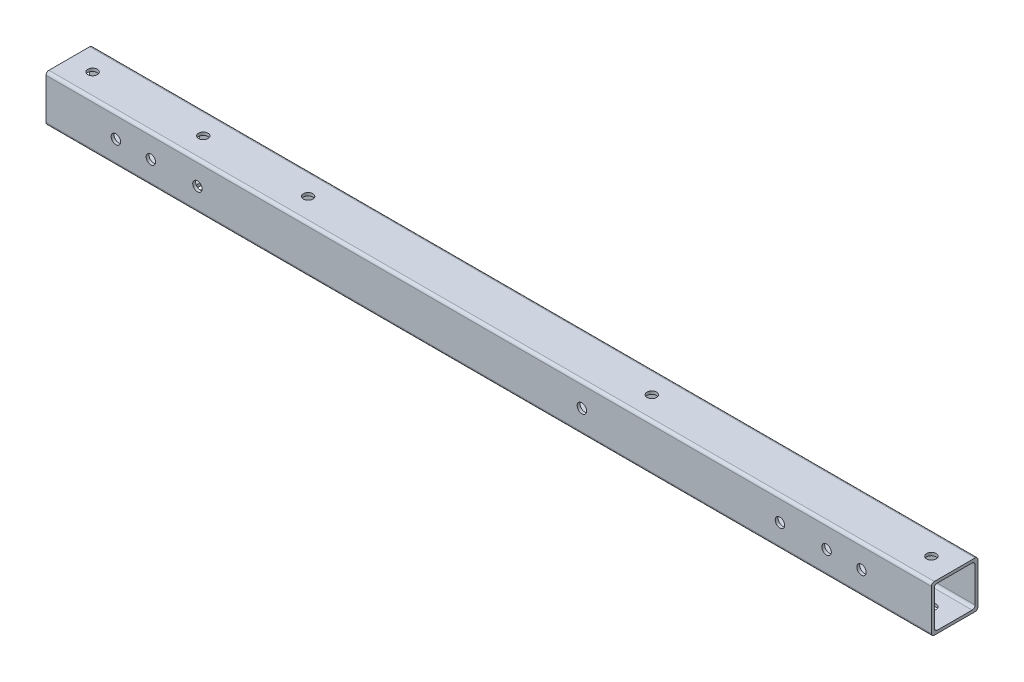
from build123d import *

# Parameters (mm, degrees)
SKETCH1_W          = 1930.4
SKETCH1_H          = 101.6
EXTRUDE1_DEPTH     = 101.6
CUT_EXTRUDE1_REACH = 1937.74
SKETCH2_W          = 88.9
SKETCH2_H          = 88.9
SKETCH3_R          = 10.31875
CUT_EXTRUDE2_DEPTH = 1936.739982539
FILLET1_R          = 6.35
SKETCH4_R          = 10.31875
CUT_EXTRUDE3_DEPTH = 101.6
SKETCH5_R          = 10.31875
CUT_EXTRUDE4_DEPTH = 101.6
SKETCH6_R          = 10.31875
CUT_EXTRUDE5_DEPTH = 101.6
SKETCH7_R          = 10.31875
CUT_EXTRUDE6_DEPTH = 101.6
SKETCH8_R          = 10.31875
CUT_EXTRUDE7_DEPTH = 101.6
SKETCH10_R         = 10.31875
CUT_EXTRUDE8_DEPTH = 1936.739982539


with BuildPart() as part:
    # Sketch1 → Extrude1 (new body)
    with BuildSketch(Plane(origin=(0, 0, 0), x_dir=(1, 0, 0), z_dir=(0, 1, 0))):
        with Locations((-965.2, -50.8)):
            Rectangle(SKETCH1_W, SKETCH1_H)
    extrude(amount=EXTRUDE1_DEPTH)

    # Sketch2 → Cut-Extrude1 (cut, up to next)
    with BuildSketch(Plane.ZY.offset(1930.4), mode=Mode.PRIVATE) as cut_extrude1_sk1:
        with Locations((50.8, 50.8)):
            Rectangle(SKETCH2_W, SKETCH2_H)
    cut_extrude1_tool1 = extrude(cut_extrude1_sk1.sketch, amount=-CUT_EXTRUDE1_REACH, mode=Mode.PRIVATE) & part.part
    add(cut_extrude1_tool1.solids().sort_by_distance((-1930.4, 50.8, 50.8))[0], mode=Mode.SUBTRACT)

    # Sketch3 → Cut-Extrude2 (cut, through all)
    with BuildSketch(Plane(origin=(0, 101.6, 0), x_dir=(1, 0, 0), z_dir=(0, 1, 0))):
        with Locations(Location((-1879.6, -50.8, 0), (0, 0, 270))):
            Circle(SKETCH3_R)
    cut_extrude2 = extrude(amount=-CUT_EXTRUDE2_DEPTH, mode=Mode.SUBTRACT)

    # Fillet1
    fillet1_edges = [part.edges().sort_by_distance(p)[0] for p in [
        (-965.2, 101.6, 101.6),
        (-965.2, 6.35, 6.35),
        (-965.2, 95.25, 6.35),
        (-965.2, 95.25, 95.25),
        (-965.2, 6.35, 95.25),
        (-965.2, 0, 101.6),
        (-965.2, 0, 0),
        (-965.2, 101.6, 0),
    ]]
    fillet(fillet1_edges, radius=FILLET1_R)

    # Sketch4 → Cut-Extrude3 (cut)
    with BuildSketch(Plane.XY):
        with Locations(Location((-1778, 50.8, 0), (0, 0, 270))):
            Circle(SKETCH4_R)
    cut_extrude3 = extrude(amount=CUT_EXTRUDE3_DEPTH, mode=Mode.SUBTRACT)

    # Sketch5 → Cut-Extrude4 (cut)
    with BuildSketch(Plane(origin=(0, 0, 0), x_dir=(-1, 0, 0), z_dir=(0, 0, -1))):
        with Locations((1701.8, 50.8)):
            Circle(SKETCH5_R)
        with Locations((1600.2, 50.8)):
            Circle(SKETCH5_R)
    cut_extrude4 = extrude(amount=-CUT_EXTRUDE4_DEPTH, mode=Mode.SUBTRACT)

    # Mirror1: Cut-Extrude2, Cut-Extrude3, Cut-Extrude4 across plane
    add(cut_extrude2.mirror(Plane(origin=(-965.2, 0, 0), x_dir=(0, 0, 1), z_dir=(1, 0, 0))), mode=Mode.SUBTRACT)
    add(cut_extrude3.mirror(Plane(origin=(-965.2, 0, 0), x_dir=(0, 0, 1), z_dir=(1, 0, 0))), mode=Mode.SUBTRACT)
    add(cut_extrude4.mirror(Plane(origin=(-965.2, 0, 0), x_dir=(0, 0, 1), z_dir=(1, 0, 0))), mode=Mode.SUBTRACT)

    # Sketch6 → Cut-Extrude5 (cut)
    with BuildSketch(Plane(origin=(0, 101.6, 0), x_dir=(1, 0, 0), z_dir=(0, 1, 0))):
        with Locations(Location((-660.4, -50.8, 0), (0, 0, 270))):
            Circle(SKETCH6_R)
    extrude(amount=-CUT_EXTRUDE5_DEPTH, mode=Mode.SUBTRACT)

    # Sketch7 → Cut-Extrude6 (cut)
    with BuildSketch(Plane(origin=(0, 0, 0), x_dir=(-1, 0, 0), z_dir=(0, 0, -1))):
        with Locations((762, 50.8)):
            Circle(SKETCH7_R)
    extrude(amount=-CUT_EXTRUDE6_DEPTH, mode=Mode.SUBTRACT)

    # Sketch8 → Cut-Extrude7 (cut)
    with BuildSketch(Plane(origin=(0, 101.6, 0), x_dir=(1, 0, 0), z_dir=(0, 1, 0))):
        with Locations(Location((-1409.7, -50.8, 0), (0, 0, 270))):
            Circle(SKETCH8_R)
    extrude(amount=-CUT_EXTRUDE7_DEPTH, mode=Mode.SUBTRACT)

    # Sketch10 → Cut-Extrude8 (cut, through all)
    with BuildSketch(Plane(origin=(0, 101.6, 0), x_dir=(1, 0, 0), z_dir=(0, 1, 0))):
        with Locations(Location((-1638.3, -50.8, 0), (0, 0, 270))):
            Circle(SKETCH10_R)
    extrude(amount=-CUT_EXTRUDE8_DEPTH, mode=Mode.SUBTRACT)


solid = part.part
